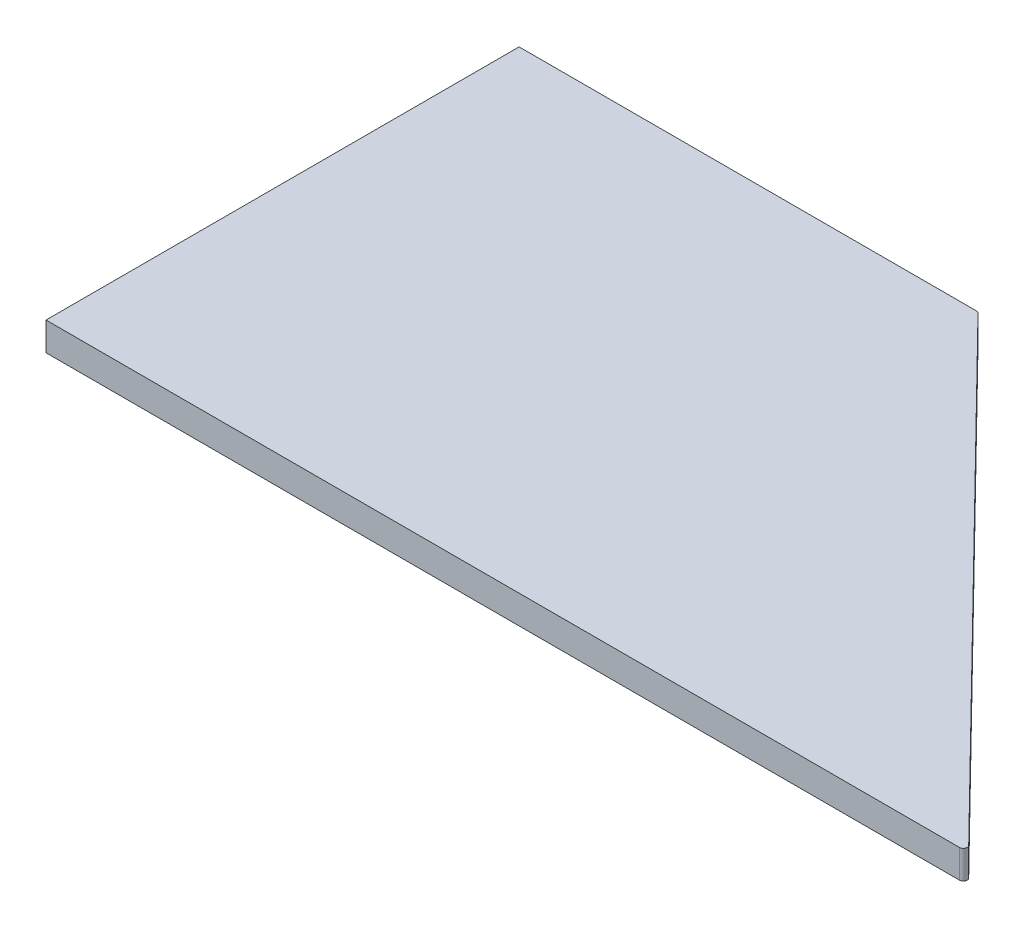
ISO-10303-21;
HEADER;
FILE_DESCRIPTION(('STEP AP214'),'2;1');
FILE_NAME('part.step','',(''),(''),'','','');
FILE_SCHEMA(('AUTOMOTIVE_DESIGN { 1 0 10303 214 1 1 1 1 }'));
ENDSEC;
DATA;
#1=APPLICATION_CONTEXT('core data for automotive mechanical design processes');
#2=APPLICATION_PROTOCOL_DEFINITION('international standard','automotive_design',2000,#1);
#3=PRODUCT_CONTEXT('',#1,'mechanical');
#4=PRODUCT('Part','Part','',(#3));
#5=PRODUCT_RELATED_PRODUCT_CATEGORY('part','',(#4));
#6=PRODUCT_DEFINITION_FORMATION('','',#4);
#7=PRODUCT_DEFINITION_CONTEXT('part definition',#1,'design');
#8=PRODUCT_DEFINITION('design','',#6,#7);
#9=PRODUCT_DEFINITION_SHAPE('','',#8);
#10=(LENGTH_UNIT() NAMED_UNIT(*) SI_UNIT(.MILLI.,.METRE.));
#11=(NAMED_UNIT(*) PLANE_ANGLE_UNIT() SI_UNIT($,.RADIAN.));
#12=(NAMED_UNIT(*) SI_UNIT($,.STERADIAN.) SOLID_ANGLE_UNIT());
#13=UNCERTAINTY_MEASURE_WITH_UNIT(LENGTH_MEASURE(1.E-05),#10,'distance_accuracy_value','');
#14=(GEOMETRIC_REPRESENTATION_CONTEXT(3) GLOBAL_UNCERTAINTY_ASSIGNED_CONTEXT((#13)) GLOBAL_UNIT_ASSIGNED_CONTEXT((#10,
#11,#12)) REPRESENTATION_CONTEXT('',''));
#15=CARTESIAN_POINT('',(0.,0.,0.));
#16=DIRECTION('',(0.,0.,1.));
#17=DIRECTION('',(1.,0.,0.));
#18=AXIS2_PLACEMENT_3D('',#15,#16,#17);
#19=CARTESIAN_POINT('',(208.396226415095,30.,-235.));
#20=DIRECTION('',(-0.714212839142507,0.,0.699928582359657));
#21=DIRECTION('',(0.699928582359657,0.,0.714212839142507));
#22=AXIS2_PLACEMENT_3D('',#19,#20,#21);
#23=PLANE('',#22);
#24=DIRECTION('',(-0.699928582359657,0.,-0.714212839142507));
#25=VECTOR('',#24,1.);
#26=CARTESIAN_POINT('',(208.396226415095,0.,-235.));
#27=LINE('',#26,#25);
#28=CARTESIAN_POINT('',(691.732506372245,0.,258.200285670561));
#29=VERTEX_POINT('',#28);
#30=CARTESIAN_POINT('',(209.572506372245,0.,-233.799714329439));
#31=VERTEX_POINT('',#30);
#32=EDGE_CURVE('E115',#29,#31,#27,.T.);
#33=ORIENTED_EDGE('',*,*,#32,.T.);
#34=DIRECTION('',(0.,-1.,0.));
#35=VECTOR('',#34,1.);
#36=CARTESIAN_POINT('',(209.572506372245,30.,-233.799714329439));
#37=LINE('',#36,#35);
#38=CARTESIAN_POINT('',(209.572506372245,30.,-233.799714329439));
#39=VERTEX_POINT('',#38);
#40=EDGE_CURVE('E40',#31,#39,#37,.F.);
#41=ORIENTED_EDGE('',*,*,#40,.T.);
#42=DIRECTION('',(-0.699928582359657,0.,-0.714212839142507));
#43=VECTOR('',#42,1.);
#44=CARTESIAN_POINT('',(208.396226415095,30.,-235.));
#45=LINE('',#44,#43);
#46=CARTESIAN_POINT('',(691.732506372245,30.,258.200285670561));
#47=VERTEX_POINT('',#46);
#48=EDGE_CURVE('E95',#47,#39,#45,.T.);
#49=ORIENTED_EDGE('',*,*,#48,.F.);
#50=DIRECTION('',(0.,-1.,0.));
#51=VECTOR('',#50,1.);
#52=CARTESIAN_POINT('',(691.732506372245,30.,258.200285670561));
#53=LINE('',#52,#51);
#54=EDGE_CURVE('E104',#47,#29,#53,.T.);
#55=ORIENTED_EDGE('',*,*,#54,.T.);
#56=EDGE_LOOP('',(#33,#41,#49,#55));
#57=FACE_BOUND('',#56,.T.);
#58=ADVANCED_FACE('F32',(#57),#23,.F.);
#59=CARTESIAN_POINT('',(-276.603773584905,30.,-235.));
#60=DIRECTION('',(0.,0.,1.));
#61=DIRECTION('',(1.,0.,0.));
#62=AXIS2_PLACEMENT_3D('',#59,#60,#61);
#63=PLANE('',#62);
#64=DIRECTION('',(-1.,0.,0.));
#65=VECTOR('',#64,1.);
#66=CARTESIAN_POINT('',(-276.603773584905,30.,-235.));
#67=LINE('',#66,#65);
#68=CARTESIAN_POINT('',(206.715655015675,30.,-235.));
#69=VERTEX_POINT('',#68);
#70=CARTESIAN_POINT('',(-276.603773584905,30.,-235.));
#71=VERTEX_POINT('',#70);
#72=EDGE_CURVE('E84',#69,#71,#67,.T.);
#73=ORIENTED_EDGE('',*,*,#72,.F.);
#74=DIRECTION('',(0.,-1.,0.));
#75=VECTOR('',#74,1.);
#76=CARTESIAN_POINT('',(206.715655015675,30.,-235.));
#77=LINE('',#76,#75);
#78=CARTESIAN_POINT('',(206.715655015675,0.,-235.));
#79=VERTEX_POINT('',#78);
#80=EDGE_CURVE('E132',#69,#79,#77,.T.);
#81=ORIENTED_EDGE('',*,*,#80,.T.);
#82=DIRECTION('',(-1.,0.,0.));
#83=VECTOR('',#82,1.);
#84=CARTESIAN_POINT('',(-276.603773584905,0.,-235.));
#85=LINE('',#84,#83);
#86=CARTESIAN_POINT('',(-276.603773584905,0.,-235.));
#87=VERTEX_POINT('',#86);
#88=EDGE_CURVE('E100',#79,#87,#85,.T.);
#89=ORIENTED_EDGE('',*,*,#88,.T.);
#90=DIRECTION('',(0.,-1.,0.));
#91=VECTOR('',#90,1.);
#92=CARTESIAN_POINT('',(-276.603773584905,30.,-235.));
#93=LINE('',#92,#91);
#94=EDGE_CURVE('E98',#71,#87,#93,.T.);
#95=ORIENTED_EDGE('',*,*,#94,.F.);
#96=EDGE_LOOP('',(#73,#81,#89,#95));
#97=FACE_BOUND('',#96,.T.);
#98=ADVANCED_FACE('F99',(#97),#63,.F.);
#99=CARTESIAN_POINT('',(-276.603773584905,30.,265.));
#100=DIRECTION('',(1.,0.,0.));
#101=DIRECTION('',(0.,0.,-1.));
#102=AXIS2_PLACEMENT_3D('',#99,#100,#101);
#103=PLANE('',#102);
#104=DIRECTION('',(0.,0.,1.));
#105=VECTOR('',#104,1.);
#106=CARTESIAN_POINT('',(-276.603773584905,0.,265.));
#107=LINE('',#106,#105);
#108=CARTESIAN_POINT('',(-276.603773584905,0.,265.));
#109=VERTEX_POINT('',#108);
#110=EDGE_CURVE('E118',#87,#109,#107,.T.);
#111=ORIENTED_EDGE('',*,*,#110,.T.);
#112=DIRECTION('',(0.,-1.,0.));
#113=VECTOR('',#112,1.);
#114=CARTESIAN_POINT('',(-276.603773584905,30.,265.));
#115=LINE('',#114,#113);
#116=CARTESIAN_POINT('',(-276.603773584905,30.,265.));
#117=VERTEX_POINT('',#116);
#118=EDGE_CURVE('E105',#117,#109,#115,.T.);
#119=ORIENTED_EDGE('',*,*,#118,.F.);
#120=DIRECTION('',(0.,0.,1.));
#121=VECTOR('',#120,1.);
#122=CARTESIAN_POINT('',(-276.603773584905,30.,265.));
#123=LINE('',#122,#121);
#124=EDGE_CURVE('E89',#71,#117,#123,.T.);
#125=ORIENTED_EDGE('',*,*,#124,.F.);
#126=ORIENTED_EDGE('',*,*,#94,.T.);
#127=EDGE_LOOP('',(#111,#119,#125,#126));
#128=FACE_BOUND('',#127,.T.);
#129=ADVANCED_FACE('F107',(#128),#103,.F.);
#130=CARTESIAN_POINT('',(208.396226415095,30.,265.));
#131=DIRECTION('',(0.,0.,-1.));
#132=DIRECTION('',(-1.,0.,0.));
#133=AXIS2_PLACEMENT_3D('',#130,#131,#132);
#134=PLANE('',#133);
#135=DIRECTION('',(1.,0.,0.));
#136=VECTOR('',#135,1.);
#137=CARTESIAN_POINT('',(208.396226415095,0.,265.));
#138=LINE('',#137,#136);
#139=CARTESIAN_POINT('',(688.875655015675,0.,265.));
#140=VERTEX_POINT('',#139);
#141=EDGE_CURVE('E120',#109,#140,#138,.T.);
#142=ORIENTED_EDGE('',*,*,#141,.T.);
#143=DIRECTION('',(0.,-1.,0.));
#144=VECTOR('',#143,1.);
#145=CARTESIAN_POINT('',(688.875655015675,30.,265.));
#146=LINE('',#145,#144);
#147=CARTESIAN_POINT('',(688.875655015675,30.,265.));
#148=VERTEX_POINT('',#147);
#149=EDGE_CURVE('E128',#140,#148,#146,.F.);
#150=ORIENTED_EDGE('',*,*,#149,.T.);
#151=DIRECTION('',(1.,0.,0.));
#152=VECTOR('',#151,1.);
#153=CARTESIAN_POINT('',(-276.603773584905,30.,265.));
#154=LINE('',#153,#152);
#155=EDGE_CURVE('E110',#117,#148,#154,.T.);
#156=ORIENTED_EDGE('',*,*,#155,.F.);
#157=ORIENTED_EDGE('',*,*,#118,.T.);
#158=EDGE_LOOP('',(#142,#150,#156,#157));
#159=FACE_BOUND('',#158,.T.);
#160=ADVANCED_FACE('F137',(#159),#134,.F.);
#161=CARTESIAN_POINT('',(0.,30.,0.));
#162=DIRECTION('',(0.,1.,0.));
#163=DIRECTION('',(0.,0.,1.));
#164=AXIS2_PLACEMENT_3D('',#161,#162,#163);
#165=PLANE('',#164);
#166=ORIENTED_EDGE('',*,*,#48,.T.);
#167=CARTESIAN_POINT('',(206.715655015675,30.,-231.));
#168=DIRECTION('',(0.,1.,0.));
#169=DIRECTION('',(0.,0.,1.));
#170=AXIS2_PLACEMENT_3D('',#167,#168,#169);
#171=CIRCLE('',#170,4.);
#172=EDGE_CURVE('E11',#39,#69,#171,.T.);
#173=ORIENTED_EDGE('',*,*,#172,.T.);
#174=ORIENTED_EDGE('',*,*,#72,.T.);
#175=ORIENTED_EDGE('',*,*,#124,.T.);
#176=ORIENTED_EDGE('',*,*,#155,.T.);
#177=CARTESIAN_POINT('',(688.875655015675,30.,261.));
#178=DIRECTION('',(0.,1.,0.));
#179=DIRECTION('',(0.,0.,1.));
#180=AXIS2_PLACEMENT_3D('',#177,#178,#179);
#181=CIRCLE('',#180,4.);
#182=EDGE_CURVE('E130',#148,#47,#181,.T.);
#183=ORIENTED_EDGE('',*,*,#182,.T.);
#184=EDGE_LOOP('',(#166,#173,#174,#175,#176,#183));
#185=FACE_BOUND('',#184,.T.);
#186=ADVANCED_FACE('F86',(#185),#165,.T.);
#187=CARTESIAN_POINT('',(0.,0.,0.));
#188=DIRECTION('',(0.,1.,0.));
#189=DIRECTION('',(0.,0.,1.));
#190=AXIS2_PLACEMENT_3D('',#187,#188,#189);
#191=PLANE('',#190);
#192=ORIENTED_EDGE('',*,*,#88,.F.);
#193=CARTESIAN_POINT('',(206.715655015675,0.,-231.));
#194=DIRECTION('',(0.,1.,0.));
#195=DIRECTION('',(0.,0.,1.));
#196=AXIS2_PLACEMENT_3D('',#193,#194,#195);
#197=CIRCLE('',#196,4.);
#198=EDGE_CURVE('E54',#79,#31,#197,.F.);
#199=ORIENTED_EDGE('',*,*,#198,.T.);
#200=ORIENTED_EDGE('',*,*,#32,.F.);
#201=CARTESIAN_POINT('',(688.875655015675,0.,261.));
#202=DIRECTION('',(0.,1.,0.));
#203=DIRECTION('',(0.,0.,1.));
#204=AXIS2_PLACEMENT_3D('',#201,#202,#203);
#205=CIRCLE('',#204,4.);
#206=EDGE_CURVE('E126',#29,#140,#205,.F.);
#207=ORIENTED_EDGE('',*,*,#206,.T.);
#208=ORIENTED_EDGE('',*,*,#141,.F.);
#209=ORIENTED_EDGE('',*,*,#110,.F.);
#210=EDGE_LOOP('',(#192,#199,#200,#207,#208,#209));
#211=FACE_BOUND('',#210,.T.);
#212=ADVANCED_FACE('F135',(#211),#191,.F.);
#213=CARTESIAN_POINT('',(688.875655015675,30.,261.));
#214=DIRECTION('',(0.,-1.,0.));
#215=DIRECTION('',(0.,0.,-1.));
#216=AXIS2_PLACEMENT_3D('',#213,#214,#215);
#217=CYLINDRICAL_SURFACE('',#216,4.);
#218=ORIENTED_EDGE('',*,*,#182,.F.);
#219=ORIENTED_EDGE('',*,*,#149,.F.);
#220=ORIENTED_EDGE('',*,*,#206,.F.);
#221=ORIENTED_EDGE('',*,*,#54,.F.);
#222=EDGE_LOOP('',(#218,#219,#220,#221));
#223=FACE_BOUND('',#222,.T.);
#224=ADVANCED_FACE('F142',(#223),#217,.T.);
#225=CARTESIAN_POINT('',(206.715655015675,30.,-231.));
#226=DIRECTION('',(0.,-1.,0.));
#227=DIRECTION('',(0.,0.,-1.));
#228=AXIS2_PLACEMENT_3D('',#225,#226,#227);
#229=CYLINDRICAL_SURFACE('',#228,4.);
#230=ORIENTED_EDGE('',*,*,#172,.F.);
#231=ORIENTED_EDGE('',*,*,#40,.F.);
#232=ORIENTED_EDGE('',*,*,#198,.F.);
#233=ORIENTED_EDGE('',*,*,#80,.F.);
#234=EDGE_LOOP('',(#230,#231,#232,#233));
#235=FACE_BOUND('',#234,.T.);
#236=ADVANCED_FACE('F34',(#235),#229,.T.);
#237=CLOSED_SHELL('',(#58,#98,#129,#160,#186,#212,#224,#236));
#238=MANIFOLD_SOLID_BREP('B2',#237);
#239=ADVANCED_BREP_SHAPE_REPRESENTATION('',(#18,#238),#14);
#240=SHAPE_DEFINITION_REPRESENTATION(#9,#239);
ENDSEC;
END-ISO-10303-21;
